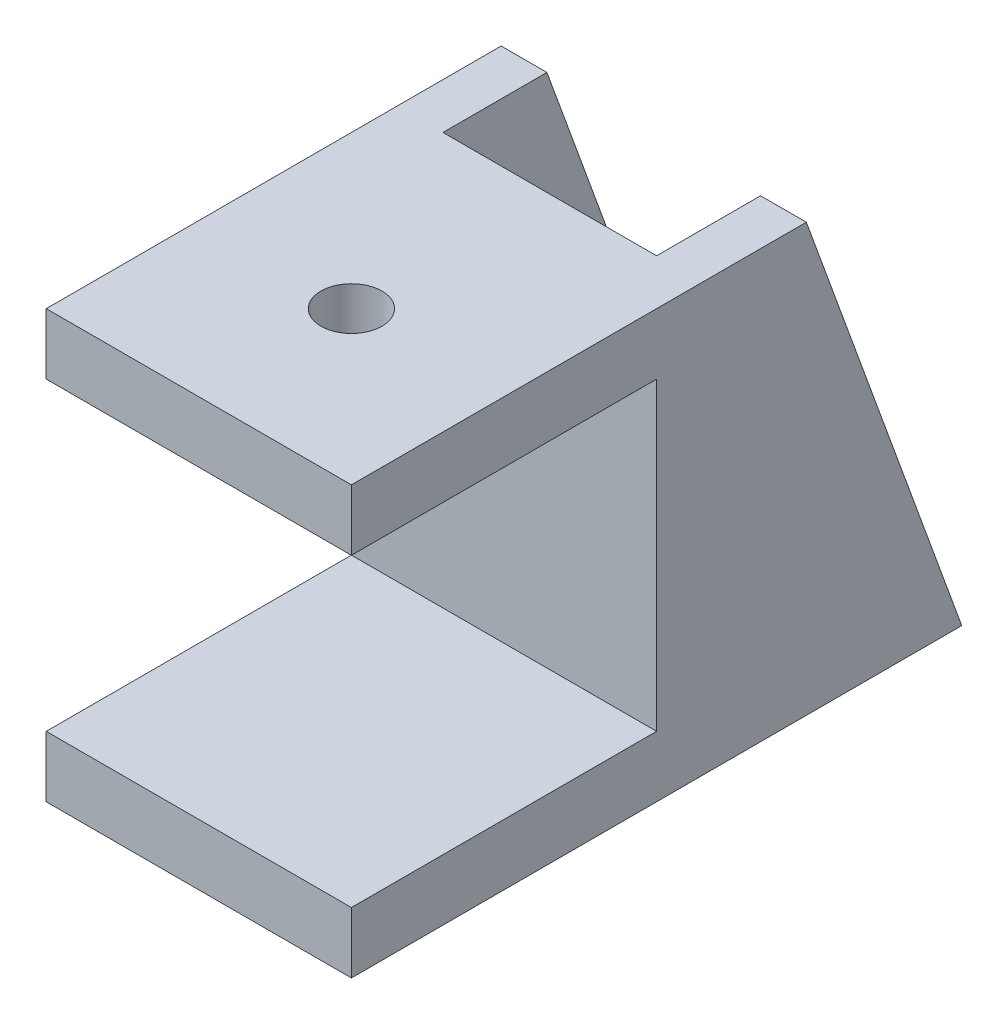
ISO-10303-21;
HEADER;
FILE_DESCRIPTION(('STEP AP214'),'2;1');
FILE_NAME('part.step','',(''),(''),'','','');
FILE_SCHEMA(('AUTOMOTIVE_DESIGN { 1 0 10303 214 1 1 1 1 }'));
ENDSEC;
DATA;
#1=APPLICATION_CONTEXT('core data for automotive mechanical design processes');
#2=APPLICATION_PROTOCOL_DEFINITION('international standard','automotive_design',2000,#1);
#3=PRODUCT_CONTEXT('',#1,'mechanical');
#4=PRODUCT('Part','Part','',(#3));
#5=PRODUCT_RELATED_PRODUCT_CATEGORY('part','',(#4));
#6=PRODUCT_DEFINITION_FORMATION('','',#4);
#7=PRODUCT_DEFINITION_CONTEXT('part definition',#1,'design');
#8=PRODUCT_DEFINITION('design','',#6,#7);
#9=PRODUCT_DEFINITION_SHAPE('','',#8);
#10=(LENGTH_UNIT() NAMED_UNIT(*) SI_UNIT(.MILLI.,.METRE.));
#11=(NAMED_UNIT(*) PLANE_ANGLE_UNIT() SI_UNIT($,.RADIAN.));
#12=(NAMED_UNIT(*) SI_UNIT($,.STERADIAN.) SOLID_ANGLE_UNIT());
#13=UNCERTAINTY_MEASURE_WITH_UNIT(LENGTH_MEASURE(1.E-05),#10,'distance_accuracy_value','');
#14=(GEOMETRIC_REPRESENTATION_CONTEXT(3) GLOBAL_UNCERTAINTY_ASSIGNED_CONTEXT((#13)) GLOBAL_UNIT_ASSIGNED_CONTEXT((#10,
#11,#12)) REPRESENTATION_CONTEXT('',''));
#15=CARTESIAN_POINT('',(0.,0.,0.));
#16=DIRECTION('',(0.,0.,1.));
#17=DIRECTION('',(1.,0.,0.));
#18=AXIS2_PLACEMENT_3D('',#15,#16,#17);
#19=CARTESIAN_POINT('',(20.,23.99,0.));
#20=DIRECTION('',(0.,-1.,0.));
#21=DIRECTION('',(0.,0.,-1.));
#22=AXIS2_PLACEMENT_3D('',#19,#20,#21);
#23=PLANE('',#22);
#24=CARTESIAN_POINT('',(10.,23.99,19.8124731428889));
#25=DIRECTION('',(0.,1.,0.));
#26=DIRECTION('',(0.,0.,1.));
#27=AXIS2_PLACEMENT_3D('',#24,#25,#26);
#28=CIRCLE('',#27,2.);
#29=CARTESIAN_POINT('',(10.,23.99,21.8124731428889));
#30=VERTEX_POINT('',#29);
#31=EDGE_CURVE('E229',#30,#30,#28,.T.);
#32=ORIENTED_EDGE('',*,*,#31,.F.);
#33=EDGE_LOOP('',(#32));
#34=FACE_BOUND('',#33,.T.);
#35=DIRECTION('',(0.,0.,1.));
#36=VECTOR('',#35,1.);
#37=CARTESIAN_POINT('',(3.,23.99,-10.1875268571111));
#38=LINE('',#37,#36);
#39=CARTESIAN_POINT('',(3.,23.99,0.));
#40=VERTEX_POINT('',#39);
#41=CARTESIAN_POINT('',(3.,23.99,6.81247314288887));
#42=VERTEX_POINT('',#41);
#43=EDGE_CURVE('E207',#40,#42,#38,.T.);
#44=ORIENTED_EDGE('',*,*,#43,.F.);
#45=DIRECTION('',(-1.,0.,0.));
#46=VECTOR('',#45,1.);
#47=CARTESIAN_POINT('',(20.,23.99,0.));
#48=LINE('',#47,#46);
#49=CARTESIAN_POINT('',(0.,23.99,0.));
#50=VERTEX_POINT('',#49);
#51=EDGE_CURVE('E262',#40,#50,#48,.T.);
#52=ORIENTED_EDGE('',*,*,#51,.T.);
#53=DIRECTION('',(0.,0.,1.));
#54=VECTOR('',#53,1.);
#55=CARTESIAN_POINT('',(0.,23.99,0.));
#56=LINE('',#55,#54);
#57=CARTESIAN_POINT('',(0.,23.99,29.8124731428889));
#58=VERTEX_POINT('',#57);
#59=EDGE_CURVE('E264',#50,#58,#56,.T.);
#60=ORIENTED_EDGE('',*,*,#59,.T.);
#61=DIRECTION('',(-1.,0.,0.));
#62=VECTOR('',#61,1.);
#63=CARTESIAN_POINT('',(20.,23.99,29.8124731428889));
#64=LINE('',#63,#62);
#65=CARTESIAN_POINT('',(20.,23.99,29.8124731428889));
#66=VERTEX_POINT('',#65);
#67=EDGE_CURVE('E319',#66,#58,#64,.T.);
#68=ORIENTED_EDGE('',*,*,#67,.F.);
#69=DIRECTION('',(0.,0.,1.));
#70=VECTOR('',#69,1.);
#71=CARTESIAN_POINT('',(20.,23.99,0.));
#72=LINE('',#71,#70);
#73=CARTESIAN_POINT('',(20.,23.99,0.));
#74=VERTEX_POINT('',#73);
#75=EDGE_CURVE('E238',#74,#66,#72,.T.);
#76=ORIENTED_EDGE('',*,*,#75,.F.);
#77=CARTESIAN_POINT('',(17.,23.99,0.));
#78=VERTEX_POINT('',#77);
#79=EDGE_CURVE('E286',#74,#78,#48,.T.);
#80=ORIENTED_EDGE('',*,*,#79,.T.);
#81=DIRECTION('',(0.,0.,-1.));
#82=VECTOR('',#81,1.);
#83=CARTESIAN_POINT('',(17.,23.99,6.81247314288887));
#84=LINE('',#83,#82);
#85=CARTESIAN_POINT('',(17.,23.99,6.81247314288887));
#86=VERTEX_POINT('',#85);
#87=EDGE_CURVE('E211',#86,#78,#84,.T.);
#88=ORIENTED_EDGE('',*,*,#87,.F.);
#89=DIRECTION('',(1.,0.,0.));
#90=VECTOR('',#89,1.);
#91=CARTESIAN_POINT('',(3.,23.99,6.81247314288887));
#92=LINE('',#91,#90);
#93=EDGE_CURVE('E223',#42,#86,#92,.T.);
#94=ORIENTED_EDGE('',*,*,#93,.F.);
#95=EDGE_LOOP('',(#44,#52,#60,#68,#76,#80,#88,#94));
#96=FACE_BOUND('',#95,.T.);
#97=ADVANCED_FACE('F44',(#34,#96),#23,.F.);
#98=CARTESIAN_POINT('',(20.,23.99,29.8124731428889));
#99=DIRECTION('',(0.,0.,-1.));
#100=DIRECTION('',(0.,1.,0.));
#101=AXIS2_PLACEMENT_3D('',#98,#99,#100);
#102=PLANE('',#101);
#103=DIRECTION('',(0.,-1.,0.));
#104=VECTOR('',#103,1.);
#105=CARTESIAN_POINT('',(0.,23.99,29.8124731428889));
#106=LINE('',#105,#104);
#107=CARTESIAN_POINT('',(0.,19.99,29.8124731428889));
#108=VERTEX_POINT('',#107);
#109=EDGE_CURVE('E270',#58,#108,#106,.T.);
#110=ORIENTED_EDGE('',*,*,#109,.T.);
#111=DIRECTION('',(-1.,0.,0.));
#112=VECTOR('',#111,1.);
#113=CARTESIAN_POINT('',(20.,19.99,29.8124731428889));
#114=LINE('',#113,#112);
#115=CARTESIAN_POINT('',(20.,19.99,29.8124731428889));
#116=VERTEX_POINT('',#115);
#117=EDGE_CURVE('E313',#116,#108,#114,.T.);
#118=ORIENTED_EDGE('',*,*,#117,.F.);
#119=DIRECTION('',(0.,-1.,0.));
#120=VECTOR('',#119,1.);
#121=CARTESIAN_POINT('',(20.,23.99,29.8124731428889));
#122=LINE('',#121,#120);
#123=EDGE_CURVE('E245',#66,#116,#122,.T.);
#124=ORIENTED_EDGE('',*,*,#123,.F.);
#125=ORIENTED_EDGE('',*,*,#67,.T.);
#126=EDGE_LOOP('',(#110,#118,#124,#125));
#127=FACE_BOUND('',#126,.T.);
#128=ADVANCED_FACE('F370',(#127),#102,.F.);
#129=CARTESIAN_POINT('',(20.,19.99,29.8124731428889));
#130=DIRECTION('',(0.,1.,0.));
#131=DIRECTION('',(0.,0.,1.));
#132=AXIS2_PLACEMENT_3D('',#129,#130,#131);
#133=PLANE('',#132);
#134=CARTESIAN_POINT('',(10.,19.99,19.8124731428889));
#135=DIRECTION('',(0.,1.,0.));
#136=DIRECTION('',(0.,0.,1.));
#137=AXIS2_PLACEMENT_3D('',#134,#135,#136);
#138=CIRCLE('',#137,2.);
#139=CARTESIAN_POINT('',(10.,19.99,21.8124731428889));
#140=VERTEX_POINT('',#139);
#141=EDGE_CURVE('E240',#140,#140,#138,.T.);
#142=ORIENTED_EDGE('',*,*,#141,.T.);
#143=EDGE_LOOP('',(#142));
#144=FACE_BOUND('',#143,.T.);
#145=DIRECTION('',(0.,0.,-1.));
#146=VECTOR('',#145,1.);
#147=CARTESIAN_POINT('',(0.,19.99,29.8124731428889));
#148=LINE('',#147,#146);
#149=CARTESIAN_POINT('',(0.,19.99,9.81247314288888));
#150=VERTEX_POINT('',#149);
#151=EDGE_CURVE('E275',#108,#150,#148,.T.);
#152=ORIENTED_EDGE('',*,*,#151,.T.);
#153=DIRECTION('',(-1.,0.,0.));
#154=VECTOR('',#153,1.);
#155=CARTESIAN_POINT('',(20.,19.99,9.81247314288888));
#156=LINE('',#155,#154);
#157=CARTESIAN_POINT('',(20.,19.99,9.81247314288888));
#158=VERTEX_POINT('',#157);
#159=EDGE_CURVE('E309',#158,#150,#156,.T.);
#160=ORIENTED_EDGE('',*,*,#159,.F.);
#161=DIRECTION('',(0.,0.,-1.));
#162=VECTOR('',#161,1.);
#163=CARTESIAN_POINT('',(20.,19.99,29.8124731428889));
#164=LINE('',#163,#162);
#165=EDGE_CURVE('E246',#116,#158,#164,.T.);
#166=ORIENTED_EDGE('',*,*,#165,.F.);
#167=ORIENTED_EDGE('',*,*,#117,.T.);
#168=EDGE_LOOP('',(#152,#160,#166,#167));
#169=FACE_BOUND('',#168,.T.);
#170=ADVANCED_FACE('F371',(#144,#169),#133,.F.);
#171=CARTESIAN_POINT('',(20.,19.99,9.81247314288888));
#172=DIRECTION('',(0.,0.,-1.));
#173=DIRECTION('',(0.,1.,0.));
#174=AXIS2_PLACEMENT_3D('',#171,#172,#173);
#175=PLANE('',#174);
#176=DIRECTION('',(0.,-1.,0.));
#177=VECTOR('',#176,1.);
#178=CARTESIAN_POINT('',(0.,19.99,9.81247314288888));
#179=LINE('',#178,#177);
#180=CARTESIAN_POINT('',(0.,0.,9.81247314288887));
#181=VERTEX_POINT('',#180);
#182=EDGE_CURVE('E273',#150,#181,#179,.T.);
#183=ORIENTED_EDGE('',*,*,#182,.T.);
#184=DIRECTION('',(-1.,0.,0.));
#185=VECTOR('',#184,1.);
#186=CARTESIAN_POINT('',(20.,0.,9.81247314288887));
#187=LINE('',#186,#185);
#188=CARTESIAN_POINT('',(20.,0.,9.81247314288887));
#189=VERTEX_POINT('',#188);
#190=EDGE_CURVE('E306',#189,#181,#187,.T.);
#191=ORIENTED_EDGE('',*,*,#190,.F.);
#192=DIRECTION('',(0.,-1.,0.));
#193=VECTOR('',#192,1.);
#194=CARTESIAN_POINT('',(20.,19.99,9.81247314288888));
#195=LINE('',#194,#193);
#196=EDGE_CURVE('E248',#158,#189,#195,.T.);
#197=ORIENTED_EDGE('',*,*,#196,.F.);
#198=ORIENTED_EDGE('',*,*,#159,.T.);
#199=EDGE_LOOP('',(#183,#191,#197,#198));
#200=FACE_BOUND('',#199,.T.);
#201=ADVANCED_FACE('F380',(#200),#175,.F.);
#202=CARTESIAN_POINT('',(20.,0.,9.81247314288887));
#203=DIRECTION('',(0.,-1.,0.));
#204=DIRECTION('',(0.,0.,-1.));
#205=AXIS2_PLACEMENT_3D('',#202,#203,#204);
#206=PLANE('',#205);
#207=DIRECTION('',(0.,0.,1.));
#208=VECTOR('',#207,1.);
#209=CARTESIAN_POINT('',(0.,0.,9.81247314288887));
#210=LINE('',#209,#208);
#211=CARTESIAN_POINT('',(0.,0.,29.8124731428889));
#212=VERTEX_POINT('',#211);
#213=EDGE_CURVE('E277',#181,#212,#210,.T.);
#214=ORIENTED_EDGE('',*,*,#213,.T.);
#215=DIRECTION('',(-1.,0.,0.));
#216=VECTOR('',#215,1.);
#217=CARTESIAN_POINT('',(20.,0.,29.8124731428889));
#218=LINE('',#217,#216);
#219=CARTESIAN_POINT('',(20.,0.,29.8124731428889));
#220=VERTEX_POINT('',#219);
#221=EDGE_CURVE('E305',#220,#212,#218,.T.);
#222=ORIENTED_EDGE('',*,*,#221,.F.);
#223=DIRECTION('',(0.,0.,1.));
#224=VECTOR('',#223,1.);
#225=CARTESIAN_POINT('',(20.,0.,9.81247314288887));
#226=LINE('',#225,#224);
#227=EDGE_CURVE('E255',#189,#220,#226,.T.);
#228=ORIENTED_EDGE('',*,*,#227,.F.);
#229=ORIENTED_EDGE('',*,*,#190,.T.);
#230=EDGE_LOOP('',(#214,#222,#228,#229));
#231=FACE_BOUND('',#230,.T.);
#232=ADVANCED_FACE('F379',(#231),#206,.F.);
#233=CARTESIAN_POINT('',(20.,0.,29.8124731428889));
#234=DIRECTION('',(0.,0.,-1.));
#235=DIRECTION('',(-1.,0.,0.));
#236=AXIS2_PLACEMENT_3D('',#233,#234,#235);
#237=PLANE('',#236);
#238=DIRECTION('',(0.,-1.,0.));
#239=VECTOR('',#238,1.);
#240=CARTESIAN_POINT('',(0.,0.,29.8124731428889));
#241=LINE('',#240,#239);
#242=CARTESIAN_POINT('',(0.,-4.00000000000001,29.8124731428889));
#243=VERTEX_POINT('',#242);
#244=EDGE_CURVE('E281',#212,#243,#241,.T.);
#245=ORIENTED_EDGE('',*,*,#244,.T.);
#246=DIRECTION('',(-1.,0.,0.));
#247=VECTOR('',#246,1.);
#248=CARTESIAN_POINT('',(20.,-4.00000000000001,29.8124731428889));
#249=LINE('',#248,#247);
#250=CARTESIAN_POINT('',(20.,-4.00000000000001,29.8124731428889));
#251=VERTEX_POINT('',#250);
#252=EDGE_CURVE('E296',#251,#243,#249,.T.);
#253=ORIENTED_EDGE('',*,*,#252,.F.);
#254=DIRECTION('',(0.,-1.,0.));
#255=VECTOR('',#254,1.);
#256=CARTESIAN_POINT('',(20.,0.,29.8124731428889));
#257=LINE('',#256,#255);
#258=EDGE_CURVE('E253',#220,#251,#257,.T.);
#259=ORIENTED_EDGE('',*,*,#258,.F.);
#260=ORIENTED_EDGE('',*,*,#221,.T.);
#261=EDGE_LOOP('',(#245,#253,#259,#260));
#262=FACE_BOUND('',#261,.T.);
#263=ADVANCED_FACE('F381',(#262),#237,.F.);
#264=CARTESIAN_POINT('',(20.,-4.00000000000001,29.8124731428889));
#265=DIRECTION('',(0.,1.,0.));
#266=DIRECTION('',(0.,0.,1.));
#267=AXIS2_PLACEMENT_3D('',#264,#265,#266);
#268=PLANE('',#267);
#269=DIRECTION('',(0.,0.,-1.));
#270=VECTOR('',#269,1.);
#271=CARTESIAN_POINT('',(13.1,-4.00000000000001,29.8124731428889));
#272=LINE('',#271,#270);
#273=CARTESIAN_POINT('',(13.1,-4.,3.31247314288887));
#274=VERTEX_POINT('',#273);
#275=CARTESIAN_POINT('',(13.1,-4.,-4.50734515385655));
#276=VERTEX_POINT('',#275);
#277=EDGE_CURVE('E198',#274,#276,#272,.T.);
#278=ORIENTED_EDGE('',*,*,#277,.T.);
#279=CARTESIAN_POINT('',(10.,-4.,-4.50734515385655));
#280=DIRECTION('',(0.,1.,0.));
#281=DIRECTION('',(0.,0.,1.));
#282=AXIS2_PLACEMENT_3D('',#279,#280,#281);
#283=CIRCLE('',#282,3.1);
#284=CARTESIAN_POINT('',(6.9,-4.,-4.50734515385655));
#285=VERTEX_POINT('',#284);
#286=EDGE_CURVE('E204',#276,#285,#283,.T.);
#287=ORIENTED_EDGE('',*,*,#286,.T.);
#288=DIRECTION('',(0.,0.,1.));
#289=VECTOR('',#288,1.);
#290=CARTESIAN_POINT('',(6.90000000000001,-4.00000000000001,29.8124731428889));
#291=LINE('',#290,#289);
#292=CARTESIAN_POINT('',(6.9,-4.,3.31247314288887));
#293=VERTEX_POINT('',#292);
#294=EDGE_CURVE('E186',#285,#293,#291,.T.);
#295=ORIENTED_EDGE('',*,*,#294,.T.);
#296=CARTESIAN_POINT('',(10.,-4.,3.31247314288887));
#297=DIRECTION('',(0.,1.,0.));
#298=DIRECTION('',(0.,0.,1.));
#299=AXIS2_PLACEMENT_3D('',#296,#297,#298);
#300=CIRCLE('',#299,3.1);
#301=EDGE_CURVE('E165',#293,#274,#300,.T.);
#302=ORIENTED_EDGE('',*,*,#301,.T.);
#303=EDGE_LOOP('',(#278,#287,#295,#302));
#304=FACE_BOUND('',#303,.T.);
#305=DIRECTION('',(0.,0.,-1.));
#306=VECTOR('',#305,1.);
#307=CARTESIAN_POINT('',(0.,-4.00000000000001,29.8124731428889));
#308=LINE('',#307,#306);
#309=CARTESIAN_POINT('',(0.,-4.,-10.1875268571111));
#310=VERTEX_POINT('',#309);
#311=EDGE_CURVE('E282',#243,#310,#308,.T.);
#312=ORIENTED_EDGE('',*,*,#311,.T.);
#313=DIRECTION('',(-1.,0.,0.));
#314=VECTOR('',#313,1.);
#315=CARTESIAN_POINT('',(20.,-4.,-10.1875268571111));
#316=LINE('',#315,#314);
#317=CARTESIAN_POINT('',(20.,-4.,-10.1875268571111));
#318=VERTEX_POINT('',#317);
#319=EDGE_CURVE('E295',#318,#310,#316,.T.);
#320=ORIENTED_EDGE('',*,*,#319,.F.);
#321=DIRECTION('',(0.,0.,-1.));
#322=VECTOR('',#321,1.);
#323=CARTESIAN_POINT('',(20.,-4.00000000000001,29.8124731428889));
#324=LINE('',#323,#322);
#325=EDGE_CURVE('E257',#251,#318,#324,.T.);
#326=ORIENTED_EDGE('',*,*,#325,.F.);
#327=ORIENTED_EDGE('',*,*,#252,.T.);
#328=EDGE_LOOP('',(#312,#320,#326,#327));
#329=FACE_BOUND('',#328,.T.);
#330=ADVANCED_FACE('F383',(#304,#329),#268,.F.);
#331=CARTESIAN_POINT('',(20.,-4.,-10.1875268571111));
#332=DIRECTION('',(0.,-0.342020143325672,0.939692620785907));
#333=DIRECTION('',(0.,-0.939692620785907,-0.342020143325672));
#334=AXIS2_PLACEMENT_3D('',#331,#332,#333);
#335=PLANE('',#334);
#336=DIRECTION('',(-1.,0.,0.));
#337=VECTOR('',#336,1.);
#338=CARTESIAN_POINT('',(20.,1.99,-8.00734515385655));
#339=LINE('',#338,#337);
#340=CARTESIAN_POINT('',(17.,1.99,-8.00734515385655));
#341=VERTEX_POINT('',#340);
#342=CARTESIAN_POINT('',(3.,1.99000000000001,-8.00734515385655));
#343=VERTEX_POINT('',#342);
#344=EDGE_CURVE('E325',#341,#343,#339,.T.);
#345=ORIENTED_EDGE('',*,*,#344,.F.);
#346=DIRECTION('',(0.,0.939692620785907,0.342020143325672));
#347=VECTOR('',#346,1.);
#348=CARTESIAN_POINT('',(17.,-4.,-10.1875268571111));
#349=LINE('',#348,#347);
#350=EDGE_CURVE('E11',#341,#78,#349,.T.);
#351=ORIENTED_EDGE('',*,*,#350,.T.);
#352=ORIENTED_EDGE('',*,*,#79,.F.);
#353=DIRECTION('',(0.,0.939692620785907,0.342020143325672));
#354=VECTOR('',#353,1.);
#355=CARTESIAN_POINT('',(20.,-4.,-10.1875268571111));
#356=LINE('',#355,#354);
#357=EDGE_CURVE('E261',#318,#74,#356,.T.);
#358=ORIENTED_EDGE('',*,*,#357,.F.);
#359=ORIENTED_EDGE('',*,*,#319,.T.);
#360=DIRECTION('',(0.,0.939692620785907,0.342020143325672));
#361=VECTOR('',#360,1.);
#362=CARTESIAN_POINT('',(0.,-4.,-10.1875268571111));
#363=LINE('',#362,#361);
#364=EDGE_CURVE('E243',#310,#50,#363,.T.);
#365=ORIENTED_EDGE('',*,*,#364,.T.);
#366=ORIENTED_EDGE('',*,*,#51,.F.);
#367=DIRECTION('',(0.,-0.939692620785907,-0.342020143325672));
#368=VECTOR('',#367,1.);
#369=CARTESIAN_POINT('',(3.,-4.,-10.1875268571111));
#370=LINE('',#369,#368);
#371=EDGE_CURVE('E52',#40,#343,#370,.T.);
#372=ORIENTED_EDGE('',*,*,#371,.T.);
#373=EDGE_LOOP('',(#345,#351,#352,#358,#359,#365,#366,#372));
#374=FACE_BOUND('',#373,.T.);
#375=ADVANCED_FACE('F334',(#374),#335,.F.);
#376=CARTESIAN_POINT('',(20.,0.,0.));
#377=DIRECTION('',(1.,0.,0.));
#378=DIRECTION('',(0.,0.,-1.));
#379=AXIS2_PLACEMENT_3D('',#376,#377,#378);
#380=PLANE('',#379);
#381=ORIENTED_EDGE('',*,*,#75,.T.);
#382=ORIENTED_EDGE('',*,*,#123,.T.);
#383=ORIENTED_EDGE('',*,*,#165,.T.);
#384=ORIENTED_EDGE('',*,*,#196,.T.);
#385=ORIENTED_EDGE('',*,*,#227,.T.);
#386=ORIENTED_EDGE('',*,*,#258,.T.);
#387=ORIENTED_EDGE('',*,*,#325,.T.);
#388=ORIENTED_EDGE('',*,*,#357,.T.);
#389=EDGE_LOOP('',(#381,#382,#383,#384,#385,#386,#387,#388));
#390=FACE_BOUND('',#389,.T.);
#391=ADVANCED_FACE('F352',(#390),#380,.T.);
#392=CARTESIAN_POINT('',(0.,0.,0.));
#393=DIRECTION('',(1.,0.,0.));
#394=DIRECTION('',(0.,0.,-1.));
#395=AXIS2_PLACEMENT_3D('',#392,#393,#394);
#396=PLANE('',#395);
#397=ORIENTED_EDGE('',*,*,#59,.F.);
#398=ORIENTED_EDGE('',*,*,#364,.F.);
#399=ORIENTED_EDGE('',*,*,#311,.F.);
#400=ORIENTED_EDGE('',*,*,#244,.F.);
#401=ORIENTED_EDGE('',*,*,#213,.F.);
#402=ORIENTED_EDGE('',*,*,#182,.F.);
#403=ORIENTED_EDGE('',*,*,#151,.F.);
#404=ORIENTED_EDGE('',*,*,#109,.F.);
#405=EDGE_LOOP('',(#397,#398,#399,#400,#401,#402,#403,#404));
#406=FACE_BOUND('',#405,.T.);
#407=ADVANCED_FACE('F365',(#406),#396,.F.);
#408=CARTESIAN_POINT('',(10.,18.99,19.8124731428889));
#409=DIRECTION('',(0.,1.,0.));
#410=DIRECTION('',(0.,0.,1.));
#411=AXIS2_PLACEMENT_3D('',#408,#409,#410);
#412=CYLINDRICAL_SURFACE('',#411,2.);
#413=ORIENTED_EDGE('',*,*,#31,.T.);
#414=EDGE_LOOP('',(#413));
#415=FACE_BOUND('',#414,.T.);
#416=ORIENTED_EDGE('',*,*,#141,.F.);
#417=EDGE_LOOP('',(#416));
#418=FACE_BOUND('',#417,.T.);
#419=ADVANCED_FACE('F403',(#415,#418),#412,.F.);
#420=CARTESIAN_POINT('',(17.,1.99,6.81247314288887));
#421=DIRECTION('',(1.,0.,0.));
#422=DIRECTION('',(0.,0.,-1.));
#423=AXIS2_PLACEMENT_3D('',#420,#421,#422);
#424=PLANE('',#423);
#425=DIRECTION('',(0.,0.,-1.));
#426=VECTOR('',#425,1.);
#427=CARTESIAN_POINT('',(17.,1.99,6.81247314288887));
#428=LINE('',#427,#426);
#429=CARTESIAN_POINT('',(17.,1.99,6.81247314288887));
#430=VERTEX_POINT('',#429);
#431=EDGE_CURVE('E214',#430,#341,#428,.T.);
#432=ORIENTED_EDGE('',*,*,#431,.F.);
#433=DIRECTION('',(0.,1.,0.));
#434=VECTOR('',#433,1.);
#435=CARTESIAN_POINT('',(17.,1.99,6.81247314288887));
#436=LINE('',#435,#434);
#437=EDGE_CURVE('E227',#430,#86,#436,.T.);
#438=ORIENTED_EDGE('',*,*,#437,.T.);
#439=ORIENTED_EDGE('',*,*,#87,.T.);
#440=ORIENTED_EDGE('',*,*,#350,.F.);
#441=EDGE_LOOP('',(#432,#438,#439,#440));
#442=FACE_BOUND('',#441,.T.);
#443=ADVANCED_FACE('F350',(#442),#424,.F.);
#444=CARTESIAN_POINT('',(3.,1.99000000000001,-10.1875268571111));
#445=DIRECTION('',(-1.,0.,0.));
#446=DIRECTION('',(0.,0.,1.));
#447=AXIS2_PLACEMENT_3D('',#444,#445,#446);
#448=PLANE('',#447);
#449=ORIENTED_EDGE('',*,*,#43,.T.);
#450=DIRECTION('',(0.,1.,0.));
#451=VECTOR('',#450,1.);
#452=CARTESIAN_POINT('',(3.,1.99,6.81247314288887));
#453=LINE('',#452,#451);
#454=CARTESIAN_POINT('',(3.,1.99,6.81247314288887));
#455=VERTEX_POINT('',#454);
#456=EDGE_CURVE('E218',#455,#42,#453,.T.);
#457=ORIENTED_EDGE('',*,*,#456,.F.);
#458=DIRECTION('',(0.,0.,1.));
#459=VECTOR('',#458,1.);
#460=CARTESIAN_POINT('',(3.,1.99000000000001,-10.1875268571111));
#461=LINE('',#460,#459);
#462=EDGE_CURVE('E210',#343,#455,#461,.T.);
#463=ORIENTED_EDGE('',*,*,#462,.F.);
#464=ORIENTED_EDGE('',*,*,#371,.F.);
#465=EDGE_LOOP('',(#449,#457,#463,#464));
#466=FACE_BOUND('',#465,.T.);
#467=ADVANCED_FACE('F337',(#466),#448,.F.);
#468=CARTESIAN_POINT('',(0.,1.99,0.));
#469=DIRECTION('',(0.,1.,0.));
#470=DIRECTION('',(0.,0.,1.));
#471=AXIS2_PLACEMENT_3D('',#468,#469,#470);
#472=PLANE('',#471);
#473=CARTESIAN_POINT('',(10.,1.99,-4.50734515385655));
#474=DIRECTION('',(0.,1.,0.));
#475=DIRECTION('',(0.,0.,1.));
#476=AXIS2_PLACEMENT_3D('',#473,#474,#475);
#477=CIRCLE('',#476,3.1);
#478=CARTESIAN_POINT('',(13.1,1.99,-4.50734515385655));
#479=VERTEX_POINT('',#478);
#480=CARTESIAN_POINT('',(6.9,1.99,-4.50734515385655));
#481=VERTEX_POINT('',#480);
#482=EDGE_CURVE('E68',#479,#481,#477,.T.);
#483=ORIENTED_EDGE('',*,*,#482,.F.);
#484=DIRECTION('',(0.,0.,-1.));
#485=VECTOR('',#484,1.);
#486=CARTESIAN_POINT('',(13.1,1.99,-4.50734515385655));
#487=LINE('',#486,#485);
#488=CARTESIAN_POINT('',(13.1,1.99,3.31247314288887));
#489=VERTEX_POINT('',#488);
#490=EDGE_CURVE('E177',#489,#479,#487,.T.);
#491=ORIENTED_EDGE('',*,*,#490,.F.);
#492=CARTESIAN_POINT('',(10.,1.99,3.31247314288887));
#493=DIRECTION('',(0.,1.,0.));
#494=DIRECTION('',(0.,0.,1.));
#495=AXIS2_PLACEMENT_3D('',#492,#493,#494);
#496=CIRCLE('',#495,3.1);
#497=CARTESIAN_POINT('',(6.9,1.99,3.31247314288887));
#498=VERTEX_POINT('',#497);
#499=EDGE_CURVE('E163',#498,#489,#496,.T.);
#500=ORIENTED_EDGE('',*,*,#499,.F.);
#501=DIRECTION('',(0.,0.,1.));
#502=VECTOR('',#501,1.);
#503=CARTESIAN_POINT('',(6.9,1.99,-4.50734515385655));
#504=LINE('',#503,#502);
#505=EDGE_CURVE('E171',#481,#498,#504,.T.);
#506=ORIENTED_EDGE('',*,*,#505,.F.);
#507=EDGE_LOOP('',(#483,#491,#500,#506));
#508=FACE_BOUND('',#507,.T.);
#509=ORIENTED_EDGE('',*,*,#344,.T.);
#510=ORIENTED_EDGE('',*,*,#462,.T.);
#511=DIRECTION('',(1.,0.,0.));
#512=VECTOR('',#511,1.);
#513=CARTESIAN_POINT('',(3.,1.99,6.81247314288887));
#514=LINE('',#513,#512);
#515=EDGE_CURVE('E208',#455,#430,#514,.T.);
#516=ORIENTED_EDGE('',*,*,#515,.T.);
#517=ORIENTED_EDGE('',*,*,#431,.T.);
#518=EDGE_LOOP('',(#509,#510,#516,#517));
#519=FACE_BOUND('',#518,.T.);
#520=ADVANCED_FACE('F176',(#508,#519),#472,.T.);
#521=CARTESIAN_POINT('',(3.,1.99,6.81247314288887));
#522=DIRECTION('',(0.,0.,1.));
#523=DIRECTION('',(0.,-1.,0.));
#524=AXIS2_PLACEMENT_3D('',#521,#522,#523);
#525=PLANE('',#524);
#526=ORIENTED_EDGE('',*,*,#93,.T.);
#527=ORIENTED_EDGE('',*,*,#437,.F.);
#528=ORIENTED_EDGE('',*,*,#515,.F.);
#529=ORIENTED_EDGE('',*,*,#456,.T.);
#530=EDGE_LOOP('',(#526,#527,#528,#529));
#531=FACE_BOUND('',#530,.T.);
#532=ADVANCED_FACE('F345',(#531),#525,.F.);
#533=CARTESIAN_POINT('',(10.,-18.01,-4.50734515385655));
#534=DIRECTION('',(0.,1.,0.));
#535=DIRECTION('',(0.,0.,1.));
#536=AXIS2_PLACEMENT_3D('',#533,#534,#535);
#537=CYLINDRICAL_SURFACE('',#536,3.1);
#538=DIRECTION('',(0.,1.,0.));
#539=VECTOR('',#538,1.);
#540=CARTESIAN_POINT('',(13.1,-18.01,-4.50734515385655));
#541=LINE('',#540,#539);
#542=EDGE_CURVE('E187',#276,#479,#541,.T.);
#543=ORIENTED_EDGE('',*,*,#542,.T.);
#544=ORIENTED_EDGE('',*,*,#482,.T.);
#545=DIRECTION('',(0.,1.,0.));
#546=VECTOR('',#545,1.);
#547=CARTESIAN_POINT('',(6.9,-18.01,-4.50734515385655));
#548=LINE('',#547,#546);
#549=EDGE_CURVE('E166',#285,#481,#548,.T.);
#550=ORIENTED_EDGE('',*,*,#549,.F.);
#551=ORIENTED_EDGE('',*,*,#286,.F.);
#552=EDGE_LOOP('',(#543,#544,#550,#551));
#553=FACE_BOUND('',#552,.T.);
#554=ADVANCED_FACE('F481',(#553),#537,.F.);
#555=CARTESIAN_POINT('',(13.1,-18.01,-4.50734515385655));
#556=DIRECTION('',(1.,0.,0.));
#557=DIRECTION('',(0.,0.,-1.));
#558=AXIS2_PLACEMENT_3D('',#555,#556,#557);
#559=PLANE('',#558);
#560=DIRECTION('',(0.,1.,0.));
#561=VECTOR('',#560,1.);
#562=CARTESIAN_POINT('',(13.1,-18.01,3.31247314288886));
#563=LINE('',#562,#561);
#564=EDGE_CURVE('E170',#274,#489,#563,.T.);
#565=ORIENTED_EDGE('',*,*,#564,.T.);
#566=ORIENTED_EDGE('',*,*,#490,.T.);
#567=ORIENTED_EDGE('',*,*,#542,.F.);
#568=ORIENTED_EDGE('',*,*,#277,.F.);
#569=EDGE_LOOP('',(#565,#566,#567,#568));
#570=FACE_BOUND('',#569,.T.);
#571=ADVANCED_FACE('F491',(#570),#559,.F.);
#572=CARTESIAN_POINT('',(10.,-18.01,3.31247314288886));
#573=DIRECTION('',(0.,1.,0.));
#574=DIRECTION('',(0.,0.,1.));
#575=AXIS2_PLACEMENT_3D('',#572,#573,#574);
#576=CYLINDRICAL_SURFACE('',#575,3.1);
#577=DIRECTION('',(0.,1.,0.));
#578=VECTOR('',#577,1.);
#579=CARTESIAN_POINT('',(6.9,-18.01,3.31247314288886));
#580=LINE('',#579,#578);
#581=EDGE_CURVE('E58',#293,#498,#580,.T.);
#582=ORIENTED_EDGE('',*,*,#581,.T.);
#583=ORIENTED_EDGE('',*,*,#499,.T.);
#584=ORIENTED_EDGE('',*,*,#564,.F.);
#585=ORIENTED_EDGE('',*,*,#301,.F.);
#586=EDGE_LOOP('',(#582,#583,#584,#585));
#587=FACE_BOUND('',#586,.T.);
#588=ADVANCED_FACE('F157',(#587),#576,.F.);
#589=CARTESIAN_POINT('',(6.9,-18.01,-4.50734515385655));
#590=DIRECTION('',(-1.,0.,0.));
#591=DIRECTION('',(0.,0.,1.));
#592=AXIS2_PLACEMENT_3D('',#589,#590,#591);
#593=PLANE('',#592);
#594=ORIENTED_EDGE('',*,*,#549,.T.);
#595=ORIENTED_EDGE('',*,*,#505,.T.);
#596=ORIENTED_EDGE('',*,*,#581,.F.);
#597=ORIENTED_EDGE('',*,*,#294,.F.);
#598=EDGE_LOOP('',(#594,#595,#596,#597));
#599=FACE_BOUND('',#598,.T.);
#600=ADVANCED_FACE('F175',(#599),#593,.F.);
#601=CLOSED_SHELL('',(#97,#128,#170,#201,#232,#263,#330,#375,#391,#407,#419,#443,#467,#520,#532,
#554,#571,#588,#600));
#602=MANIFOLD_SOLID_BREP('B2',#601);
#603=ADVANCED_BREP_SHAPE_REPRESENTATION('',(#18,#602),#14);
#604=SHAPE_DEFINITION_REPRESENTATION(#9,#603);
ENDSEC;
END-ISO-10303-21;
